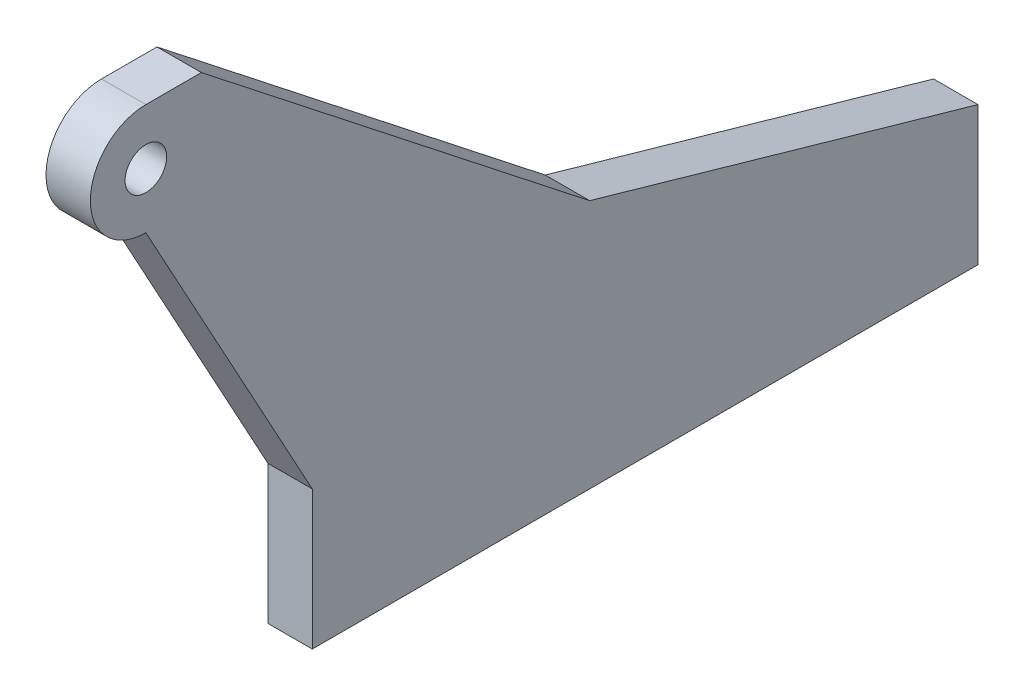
ISO-10303-21;
HEADER;
FILE_DESCRIPTION(('STEP AP214'),'2;1');
FILE_NAME('part.step','',(''),(''),'','','');
FILE_SCHEMA(('AUTOMOTIVE_DESIGN { 1 0 10303 214 1 1 1 1 }'));
ENDSEC;
DATA;
#1=APPLICATION_CONTEXT('core data for automotive mechanical design processes');
#2=APPLICATION_PROTOCOL_DEFINITION('international standard','automotive_design',2000,#1);
#3=PRODUCT_CONTEXT('',#1,'mechanical');
#4=PRODUCT('Part','Part','',(#3));
#5=PRODUCT_RELATED_PRODUCT_CATEGORY('part','',(#4));
#6=PRODUCT_DEFINITION_FORMATION('','',#4);
#7=PRODUCT_DEFINITION_CONTEXT('part definition',#1,'design');
#8=PRODUCT_DEFINITION('design','',#6,#7);
#9=PRODUCT_DEFINITION_SHAPE('','',#8);
#10=(LENGTH_UNIT() NAMED_UNIT(*) SI_UNIT(.MILLI.,.METRE.));
#11=(NAMED_UNIT(*) PLANE_ANGLE_UNIT() SI_UNIT($,.RADIAN.));
#12=(NAMED_UNIT(*) SI_UNIT($,.STERADIAN.) SOLID_ANGLE_UNIT());
#13=UNCERTAINTY_MEASURE_WITH_UNIT(LENGTH_MEASURE(1.E-05),#10,'distance_accuracy_value','');
#14=(GEOMETRIC_REPRESENTATION_CONTEXT(3) GLOBAL_UNCERTAINTY_ASSIGNED_CONTEXT((#13)) GLOBAL_UNIT_ASSIGNED_CONTEXT((#10,
#11,#12)) REPRESENTATION_CONTEXT('',''));
#15=CARTESIAN_POINT('',(0.,0.,0.));
#16=DIRECTION('',(0.,0.,1.));
#17=DIRECTION('',(1.,0.,0.));
#18=AXIS2_PLACEMENT_3D('',#15,#16,#17);
#19=CARTESIAN_POINT('',(1.6,18.,6.00000000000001));
#20=DIRECTION('',(1.,0.,0.));
#21=DIRECTION('',(0.,0.,-1.));
#22=AXIS2_PLACEMENT_3D('',#19,#20,#21);
#23=PLANE('',#22);
#24=DIRECTION('',(0.,-1.,0.));
#25=VECTOR('',#24,1.);
#26=CARTESIAN_POINT('',(1.6,0.,0.));
#27=LINE('',#26,#25);
#28=CARTESIAN_POINT('',(1.6,5.,0.));
#29=VERTEX_POINT('',#28);
#30=CARTESIAN_POINT('',(1.6,0.,0.));
#31=VERTEX_POINT('',#30);
#32=EDGE_CURVE('E145',#29,#31,#27,.T.);
#33=ORIENTED_EDGE('',*,*,#32,.T.);
#34=DIRECTION('',(0.,0.,-1.));
#35=VECTOR('',#34,1.);
#36=CARTESIAN_POINT('',(1.6,0.,0.));
#37=LINE('',#36,#35);
#38=CARTESIAN_POINT('',(1.6,0.,-24.));
#39=VERTEX_POINT('',#38);
#40=EDGE_CURVE('E93',#31,#39,#37,.T.);
#41=ORIENTED_EDGE('',*,*,#40,.T.);
#42=DIRECTION('',(0.,1.,0.));
#43=VECTOR('',#42,1.);
#44=CARTESIAN_POINT('',(1.6,0.,-24.));
#45=LINE('',#44,#43);
#46=CARTESIAN_POINT('',(1.6,5.,-24.));
#47=VERTEX_POINT('',#46);
#48=EDGE_CURVE('E160',#39,#47,#45,.T.);
#49=ORIENTED_EDGE('',*,*,#48,.T.);
#50=DIRECTION('',(0.,0.274721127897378,0.961523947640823));
#51=VECTOR('',#50,1.);
#52=CARTESIAN_POINT('',(1.6,5.,-24.));
#53=LINE('',#52,#51);
#54=CARTESIAN_POINT('',(1.6,9.,-10.));
#55=VERTEX_POINT('',#54);
#56=EDGE_CURVE('E173',#47,#55,#53,.T.);
#57=ORIENTED_EDGE('',*,*,#56,.T.);
#58=DIRECTION('',(0.,0.617821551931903,0.786318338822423));
#59=VECTOR('',#58,1.);
#60=CARTESIAN_POINT('',(1.6,9.,-10.));
#61=LINE('',#60,#59);
#62=CARTESIAN_POINT('',(1.6,20.,4.00000000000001));
#63=VERTEX_POINT('',#62);
#64=EDGE_CURVE('E112',#55,#63,#61,.T.);
#65=ORIENTED_EDGE('',*,*,#64,.T.);
#66=DIRECTION('',(0.,0.,1.));
#67=VECTOR('',#66,1.);
#68=CARTESIAN_POINT('',(1.6,20.,4.00000000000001));
#69=LINE('',#68,#67);
#70=CARTESIAN_POINT('',(1.6,20.,6.00000000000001));
#71=VERTEX_POINT('',#70);
#72=EDGE_CURVE('E106',#63,#71,#69,.T.);
#73=ORIENTED_EDGE('',*,*,#72,.T.);
#74=CARTESIAN_POINT('',(1.6,18.,6.00000000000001));
#75=DIRECTION('',(1.,0.,0.));
#76=DIRECTION('',(0.,0.,-1.));
#77=AXIS2_PLACEMENT_3D('',#74,#75,#76);
#78=CIRCLE('',#77,2.);
#79=CARTESIAN_POINT('',(1.6,16.,6.00000000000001));
#80=VERTEX_POINT('',#79);
#81=EDGE_CURVE('E110',#71,#80,#78,.T.);
#82=ORIENTED_EDGE('',*,*,#81,.T.);
#83=DIRECTION('',(0.,-0.877895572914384,-0.478852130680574));
#84=VECTOR('',#83,1.);
#85=CARTESIAN_POINT('',(1.6,5.,0.));
#86=LINE('',#85,#84);
#87=EDGE_CURVE('E50',#80,#29,#86,.T.);
#88=ORIENTED_EDGE('',*,*,#87,.T.);
#89=EDGE_LOOP('',(#33,#41,#49,#57,#65,#73,#82,#88));
#90=FACE_BOUND('',#89,.T.);
#91=CARTESIAN_POINT('',(1.6,18.,6.00000000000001));
#92=DIRECTION('',(1.,0.,0.));
#93=DIRECTION('',(0.,0.,-1.));
#94=AXIS2_PLACEMENT_3D('',#91,#92,#93);
#95=CIRCLE('',#94,0.750000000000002);
#96=CARTESIAN_POINT('',(1.6,18.,5.25));
#97=VERTEX_POINT('',#96);
#98=EDGE_CURVE('E134',#97,#97,#95,.T.);
#99=ORIENTED_EDGE('',*,*,#98,.F.);
#100=EDGE_LOOP('',(#99));
#101=FACE_BOUND('',#100,.T.);
#102=ADVANCED_FACE('F33',(#90,#101),#23,.T.);
#103=CARTESIAN_POINT('',(0.,18.,6.00000000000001));
#104=DIRECTION('',(1.,0.,0.));
#105=DIRECTION('',(0.,0.,-1.));
#106=AXIS2_PLACEMENT_3D('',#103,#104,#105);
#107=PLANE('',#106);
#108=DIRECTION('',(0.,-1.,0.));
#109=VECTOR('',#108,1.);
#110=CARTESIAN_POINT('',(0.,0.,0.));
#111=LINE('',#110,#109);
#112=CARTESIAN_POINT('',(0.,5.,0.));
#113=VERTEX_POINT('',#112);
#114=CARTESIAN_POINT('',(0.,0.,0.));
#115=VERTEX_POINT('',#114);
#116=EDGE_CURVE('E130',#113,#115,#111,.T.);
#117=ORIENTED_EDGE('',*,*,#116,.F.);
#118=DIRECTION('',(0.,-0.877895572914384,-0.478852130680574));
#119=VECTOR('',#118,1.);
#120=CARTESIAN_POINT('',(0.,5.,0.));
#121=LINE('',#120,#119);
#122=CARTESIAN_POINT('',(0.,16.,6.00000000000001));
#123=VERTEX_POINT('',#122);
#124=EDGE_CURVE('E85',#123,#113,#121,.T.);
#125=ORIENTED_EDGE('',*,*,#124,.F.);
#126=CARTESIAN_POINT('',(0.,18.,6.00000000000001));
#127=DIRECTION('',(1.,0.,0.));
#128=DIRECTION('',(0.,0.,-1.));
#129=AXIS2_PLACEMENT_3D('',#126,#127,#128);
#130=CIRCLE('',#129,2.);
#131=CARTESIAN_POINT('',(0.,20.,6.00000000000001));
#132=VERTEX_POINT('',#131);
#133=EDGE_CURVE('E79',#132,#123,#130,.T.);
#134=ORIENTED_EDGE('',*,*,#133,.F.);
#135=DIRECTION('',(0.,0.,1.));
#136=VECTOR('',#135,1.);
#137=CARTESIAN_POINT('',(0.,20.,4.00000000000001));
#138=LINE('',#137,#136);
#139=CARTESIAN_POINT('',(0.,20.,4.00000000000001));
#140=VERTEX_POINT('',#139);
#141=EDGE_CURVE('E120',#140,#132,#138,.T.);
#142=ORIENTED_EDGE('',*,*,#141,.F.);
#143=DIRECTION('',(0.,0.617821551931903,0.786318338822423));
#144=VECTOR('',#143,1.);
#145=CARTESIAN_POINT('',(0.,9.,-10.));
#146=LINE('',#145,#144);
#147=CARTESIAN_POINT('',(0.,9.,-10.));
#148=VERTEX_POINT('',#147);
#149=EDGE_CURVE('E140',#148,#140,#146,.T.);
#150=ORIENTED_EDGE('',*,*,#149,.F.);
#151=DIRECTION('',(0.,0.274721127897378,0.961523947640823));
#152=VECTOR('',#151,1.);
#153=CARTESIAN_POINT('',(0.,5.,-24.));
#154=LINE('',#153,#152);
#155=CARTESIAN_POINT('',(0.,5.,-24.));
#156=VERTEX_POINT('',#155);
#157=EDGE_CURVE('E138',#156,#148,#154,.T.);
#158=ORIENTED_EDGE('',*,*,#157,.F.);
#159=DIRECTION('',(0.,1.,0.));
#160=VECTOR('',#159,1.);
#161=CARTESIAN_POINT('',(0.,0.,-24.));
#162=LINE('',#161,#160);
#163=CARTESIAN_POINT('',(0.,0.,-24.));
#164=VERTEX_POINT('',#163);
#165=EDGE_CURVE('E136',#164,#156,#162,.T.);
#166=ORIENTED_EDGE('',*,*,#165,.F.);
#167=DIRECTION('',(0.,0.,-1.));
#168=VECTOR('',#167,1.);
#169=CARTESIAN_POINT('',(0.,0.,0.));
#170=LINE('',#169,#168);
#171=EDGE_CURVE('E133',#115,#164,#170,.T.);
#172=ORIENTED_EDGE('',*,*,#171,.F.);
#173=EDGE_LOOP('',(#117,#125,#134,#142,#150,#158,#166,#172));
#174=FACE_BOUND('',#173,.T.);
#175=CARTESIAN_POINT('',(0.,18.,6.00000000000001));
#176=DIRECTION('',(1.,0.,0.));
#177=DIRECTION('',(0.,0.,-1.));
#178=AXIS2_PLACEMENT_3D('',#175,#176,#177);
#179=CIRCLE('',#178,0.750000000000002);
#180=CARTESIAN_POINT('',(0.,18.,5.25));
#181=VERTEX_POINT('',#180);
#182=EDGE_CURVE('E179',#181,#181,#179,.T.);
#183=ORIENTED_EDGE('',*,*,#182,.T.);
#184=EDGE_LOOP('',(#183));
#185=FACE_BOUND('',#184,.T.);
#186=ADVANCED_FACE('F164',(#174,#185),#107,.F.);
#187=CARTESIAN_POINT('',(1.6,0.,0.));
#188=DIRECTION('',(0.,0.,-1.));
#189=DIRECTION('',(-1.,0.,0.));
#190=AXIS2_PLACEMENT_3D('',#187,#188,#189);
#191=PLANE('',#190);
#192=ORIENTED_EDGE('',*,*,#116,.T.);
#193=DIRECTION('',(-1.,0.,0.));
#194=VECTOR('',#193,1.);
#195=CARTESIAN_POINT('',(1.6,0.,0.));
#196=LINE('',#195,#194);
#197=EDGE_CURVE('E11',#31,#115,#196,.T.);
#198=ORIENTED_EDGE('',*,*,#197,.F.);
#199=ORIENTED_EDGE('',*,*,#32,.F.);
#200=DIRECTION('',(-1.,0.,0.));
#201=VECTOR('',#200,1.);
#202=CARTESIAN_POINT('',(1.6,5.,0.));
#203=LINE('',#202,#201);
#204=EDGE_CURVE('E126',#29,#113,#203,.T.);
#205=ORIENTED_EDGE('',*,*,#204,.T.);
#206=EDGE_LOOP('',(#192,#198,#199,#205));
#207=FACE_BOUND('',#206,.T.);
#208=ADVANCED_FACE('F35',(#207),#191,.F.);
#209=CARTESIAN_POINT('',(1.6,0.,0.));
#210=DIRECTION('',(0.,1.,0.));
#211=DIRECTION('',(0.,0.,1.));
#212=AXIS2_PLACEMENT_3D('',#209,#210,#211);
#213=PLANE('',#212);
#214=ORIENTED_EDGE('',*,*,#171,.T.);
#215=DIRECTION('',(-1.,0.,0.));
#216=VECTOR('',#215,1.);
#217=CARTESIAN_POINT('',(1.6,0.,-24.));
#218=LINE('',#217,#216);
#219=EDGE_CURVE('E42',#39,#164,#218,.T.);
#220=ORIENTED_EDGE('',*,*,#219,.F.);
#221=ORIENTED_EDGE('',*,*,#40,.F.);
#222=ORIENTED_EDGE('',*,*,#197,.T.);
#223=EDGE_LOOP('',(#214,#220,#221,#222));
#224=FACE_BOUND('',#223,.T.);
#225=ADVANCED_FACE('F207',(#224),#213,.F.);
#226=CARTESIAN_POINT('',(1.6,0.,-24.));
#227=DIRECTION('',(0.,0.,1.));
#228=DIRECTION('',(1.,0.,0.));
#229=AXIS2_PLACEMENT_3D('',#226,#227,#228);
#230=PLANE('',#229);
#231=ORIENTED_EDGE('',*,*,#165,.T.);
#232=DIRECTION('',(-1.,0.,0.));
#233=VECTOR('',#232,1.);
#234=CARTESIAN_POINT('',(1.6,5.,-24.));
#235=LINE('',#234,#233);
#236=EDGE_CURVE('E152',#47,#156,#235,.T.);
#237=ORIENTED_EDGE('',*,*,#236,.F.);
#238=ORIENTED_EDGE('',*,*,#48,.F.);
#239=ORIENTED_EDGE('',*,*,#219,.T.);
#240=EDGE_LOOP('',(#231,#237,#238,#239));
#241=FACE_BOUND('',#240,.T.);
#242=ADVANCED_FACE('F158',(#241),#230,.F.);
#243=CARTESIAN_POINT('',(1.6,5.,-24.));
#244=DIRECTION('',(0.,-0.961523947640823,0.274721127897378));
#245=DIRECTION('',(0.,-0.274721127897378,-0.961523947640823));
#246=AXIS2_PLACEMENT_3D('',#243,#244,#245);
#247=PLANE('',#246);
#248=ORIENTED_EDGE('',*,*,#157,.T.);
#249=DIRECTION('',(-1.,0.,0.));
#250=VECTOR('',#249,1.);
#251=CARTESIAN_POINT('',(1.6,9.,-10.));
#252=LINE('',#251,#250);
#253=EDGE_CURVE('E149',#55,#148,#252,.T.);
#254=ORIENTED_EDGE('',*,*,#253,.F.);
#255=ORIENTED_EDGE('',*,*,#56,.F.);
#256=ORIENTED_EDGE('',*,*,#236,.T.);
#257=EDGE_LOOP('',(#248,#254,#255,#256));
#258=FACE_BOUND('',#257,.T.);
#259=ADVANCED_FACE('F169',(#258),#247,.F.);
#260=CARTESIAN_POINT('',(1.6,9.,-10.));
#261=DIRECTION('',(0.,-0.786318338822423,0.617821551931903));
#262=DIRECTION('',(0.,-0.617821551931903,-0.786318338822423));
#263=AXIS2_PLACEMENT_3D('',#260,#261,#262);
#264=PLANE('',#263);
#265=ORIENTED_EDGE('',*,*,#149,.T.);
#266=DIRECTION('',(-1.,0.,0.));
#267=VECTOR('',#266,1.);
#268=CARTESIAN_POINT('',(1.6,20.,4.00000000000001));
#269=LINE('',#268,#267);
#270=EDGE_CURVE('E121',#63,#140,#269,.T.);
#271=ORIENTED_EDGE('',*,*,#270,.F.);
#272=ORIENTED_EDGE('',*,*,#64,.F.);
#273=ORIENTED_EDGE('',*,*,#253,.T.);
#274=EDGE_LOOP('',(#265,#271,#272,#273));
#275=FACE_BOUND('',#274,.T.);
#276=ADVANCED_FACE('F172',(#275),#264,.F.);
#277=CARTESIAN_POINT('',(1.6,20.,4.00000000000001));
#278=DIRECTION('',(0.,-1.,0.));
#279=DIRECTION('',(0.,0.,-1.));
#280=AXIS2_PLACEMENT_3D('',#277,#278,#279);
#281=PLANE('',#280);
#282=ORIENTED_EDGE('',*,*,#141,.T.);
#283=DIRECTION('',(-1.,0.,0.));
#284=VECTOR('',#283,1.);
#285=CARTESIAN_POINT('',(1.6,20.,6.00000000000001));
#286=LINE('',#285,#284);
#287=EDGE_CURVE('E117',#71,#132,#286,.T.);
#288=ORIENTED_EDGE('',*,*,#287,.F.);
#289=ORIENTED_EDGE('',*,*,#72,.F.);
#290=ORIENTED_EDGE('',*,*,#270,.T.);
#291=EDGE_LOOP('',(#282,#288,#289,#290));
#292=FACE_BOUND('',#291,.T.);
#293=ADVANCED_FACE('F118',(#292),#281,.F.);
#294=CARTESIAN_POINT('',(1.6,18.,6.00000000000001));
#295=DIRECTION('',(-1.,0.,0.));
#296=DIRECTION('',(0.,0.,1.));
#297=AXIS2_PLACEMENT_3D('',#294,#295,#296);
#298=CYLINDRICAL_SURFACE('',#297,2.);
#299=ORIENTED_EDGE('',*,*,#133,.T.);
#300=DIRECTION('',(-1.,0.,0.));
#301=VECTOR('',#300,1.);
#302=CARTESIAN_POINT('',(1.6,16.,6.00000000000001));
#303=LINE('',#302,#301);
#304=EDGE_CURVE('E122',#80,#123,#303,.T.);
#305=ORIENTED_EDGE('',*,*,#304,.F.);
#306=ORIENTED_EDGE('',*,*,#81,.F.);
#307=ORIENTED_EDGE('',*,*,#287,.T.);
#308=EDGE_LOOP('',(#299,#305,#306,#307));
#309=FACE_BOUND('',#308,.T.);
#310=ADVANCED_FACE('F124',(#309),#298,.T.);
#311=CARTESIAN_POINT('',(1.6,5.,0.));
#312=DIRECTION('',(0.,0.478852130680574,-0.877895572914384));
#313=DIRECTION('',(0.,0.877895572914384,0.478852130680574));
#314=AXIS2_PLACEMENT_3D('',#311,#312,#313);
#315=PLANE('',#314);
#316=ORIENTED_EDGE('',*,*,#124,.T.);
#317=ORIENTED_EDGE('',*,*,#204,.F.);
#318=ORIENTED_EDGE('',*,*,#87,.F.);
#319=ORIENTED_EDGE('',*,*,#304,.T.);
#320=EDGE_LOOP('',(#316,#317,#318,#319));
#321=FACE_BOUND('',#320,.T.);
#322=ADVANCED_FACE('F195',(#321),#315,.F.);
#323=CARTESIAN_POINT('',(1.6,18.,6.00000000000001));
#324=DIRECTION('',(-1.,0.,0.));
#325=DIRECTION('',(0.,0.,1.));
#326=AXIS2_PLACEMENT_3D('',#323,#324,#325);
#327=CYLINDRICAL_SURFACE('',#326,0.750000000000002);
#328=ORIENTED_EDGE('',*,*,#98,.T.);
#329=EDGE_LOOP('',(#328));
#330=FACE_BOUND('',#329,.T.);
#331=ORIENTED_EDGE('',*,*,#182,.F.);
#332=EDGE_LOOP('',(#331));
#333=FACE_BOUND('',#332,.T.);
#334=ADVANCED_FACE('F185',(#330,#333),#327,.F.);
#335=CLOSED_SHELL('',(#102,#186,#208,#225,#242,#259,#276,#293,#310,#322,#334));
#336=MANIFOLD_SOLID_BREP('B2',#335);
#337=ADVANCED_BREP_SHAPE_REPRESENTATION('',(#18,#336),#14);
#338=SHAPE_DEFINITION_REPRESENTATION(#9,#337);
ENDSEC;
END-ISO-10303-21;
